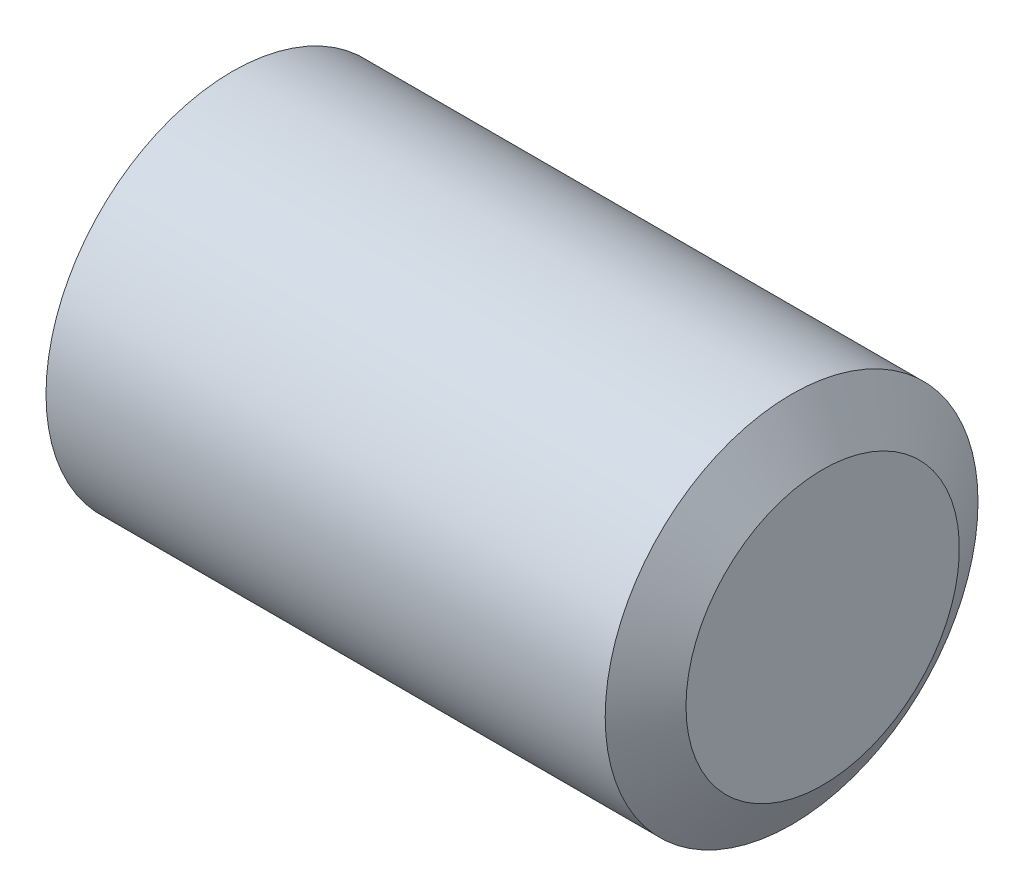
ISO-10303-21;
HEADER;
FILE_DESCRIPTION(('STEP AP214'),'2;1');
FILE_NAME('part.step','',(''),(''),'','','');
FILE_SCHEMA(('AUTOMOTIVE_DESIGN { 1 0 10303 214 1 1 1 1 }'));
ENDSEC;
DATA;
#1=APPLICATION_CONTEXT('core data for automotive mechanical design processes');
#2=APPLICATION_PROTOCOL_DEFINITION('international standard','automotive_design',2000,#1);
#3=PRODUCT_CONTEXT('',#1,'mechanical');
#4=PRODUCT('Part','Part','',(#3));
#5=PRODUCT_RELATED_PRODUCT_CATEGORY('part','',(#4));
#6=PRODUCT_DEFINITION_FORMATION('','',#4);
#7=PRODUCT_DEFINITION_CONTEXT('part definition',#1,'design');
#8=PRODUCT_DEFINITION('design','',#6,#7);
#9=PRODUCT_DEFINITION_SHAPE('','',#8);
#10=(LENGTH_UNIT() NAMED_UNIT(*) SI_UNIT(.MILLI.,.METRE.));
#11=(NAMED_UNIT(*) PLANE_ANGLE_UNIT() SI_UNIT($,.RADIAN.));
#12=(NAMED_UNIT(*) SI_UNIT($,.STERADIAN.) SOLID_ANGLE_UNIT());
#13=UNCERTAINTY_MEASURE_WITH_UNIT(LENGTH_MEASURE(1.E-05),#10,'distance_accuracy_value','');
#14=(GEOMETRIC_REPRESENTATION_CONTEXT(3) GLOBAL_UNCERTAINTY_ASSIGNED_CONTEXT((#13)) GLOBAL_UNIT_ASSIGNED_CONTEXT((#10,
#11,#12)) REPRESENTATION_CONTEXT('',''));
#15=CARTESIAN_POINT('',(0.,0.,0.));
#16=DIRECTION('',(0.,0.,1.));
#17=DIRECTION('',(1.,0.,0.));
#18=AXIS2_PLACEMENT_3D('',#15,#16,#17);
#19=CARTESIAN_POINT('',(0.,0.,0.));
#20=DIRECTION('',(1.,0.,0.));
#21=DIRECTION('',(0.,0.,-1.));
#22=AXIS2_PLACEMENT_3D('',#19,#20,#21);
#23=PLANE('',#22);
#24=CARTESIAN_POINT('',(0.,0.,0.));
#25=DIRECTION('',(-1.,0.,0.));
#26=DIRECTION('',(0.,0.,1.));
#27=AXIS2_PLACEMENT_3D('',#24,#25,#26);
#28=CIRCLE('',#27,22.);
#29=CARTESIAN_POINT('',(0.,0.,22.));
#30=VERTEX_POINT('',#29);
#31=EDGE_CURVE('E10',#30,#30,#28,.T.);
#32=ORIENTED_EDGE('',*,*,#31,.T.);
#33=EDGE_LOOP('',(#32));
#34=FACE_BOUND('',#33,.T.);
#35=ADVANCED_FACE('F33',(#34),#23,.F.);
#36=CARTESIAN_POINT('',(5.,0.,0.));
#37=DIRECTION('',(1.,0.,0.));
#38=DIRECTION('',(0.,0.,-1.));
#39=AXIS2_PLACEMENT_3D('',#36,#37,#38);
#40=CONICAL_SURFACE('',#39,30.,1.01219701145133);
#41=ORIENTED_EDGE('',*,*,#31,.F.);
#42=EDGE_LOOP('',(#41));
#43=FACE_BOUND('',#42,.T.);
#44=CARTESIAN_POINT('',(5.,0.,0.));
#45=DIRECTION('',(-1.,0.,0.));
#46=DIRECTION('',(0.,0.,1.));
#47=AXIS2_PLACEMENT_3D('',#44,#45,#46);
#48=CIRCLE('',#47,30.);
#49=CARTESIAN_POINT('',(5.,0.,30.));
#50=VERTEX_POINT('',#49);
#51=EDGE_CURVE('E39',#50,#50,#48,.T.);
#52=ORIENTED_EDGE('',*,*,#51,.T.);
#53=EDGE_LOOP('',(#52));
#54=FACE_BOUND('',#53,.T.);
#55=ADVANCED_FACE('F65',(#43,#54),#40,.T.);
#56=CARTESIAN_POINT('',(0.,0.,0.));
#57=DIRECTION('',(-1.,0.,0.));
#58=DIRECTION('',(0.,0.,1.));
#59=AXIS2_PLACEMENT_3D('',#56,#57,#58);
#60=CYLINDRICAL_SURFACE('',#59,30.);
#61=ORIENTED_EDGE('',*,*,#51,.F.);
#62=EDGE_LOOP('',(#61));
#63=FACE_BOUND('',#62,.T.);
#64=CARTESIAN_POINT('',(95.,0.,0.));
#65=DIRECTION('',(-1.,0.,0.));
#66=DIRECTION('',(0.,0.,1.));
#67=AXIS2_PLACEMENT_3D('',#64,#65,#66);
#68=CIRCLE('',#67,30.);
#69=CARTESIAN_POINT('',(95.,0.,30.));
#70=VERTEX_POINT('',#69);
#71=EDGE_CURVE('E43',#70,#70,#68,.T.);
#72=ORIENTED_EDGE('',*,*,#71,.T.);
#73=EDGE_LOOP('',(#72));
#74=FACE_BOUND('',#73,.T.);
#75=ADVANCED_FACE('F61',(#63,#74),#60,.T.);
#76=CARTESIAN_POINT('',(100.,0.,0.));
#77=DIRECTION('',(-1.,0.,0.));
#78=DIRECTION('',(0.,0.,1.));
#79=AXIS2_PLACEMENT_3D('',#76,#77,#78);
#80=CONICAL_SURFACE('',#79,22.,1.01219701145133);
#81=ORIENTED_EDGE('',*,*,#71,.F.);
#82=EDGE_LOOP('',(#81));
#83=FACE_BOUND('',#82,.T.);
#84=CARTESIAN_POINT('',(100.,0.,0.));
#85=DIRECTION('',(-1.,0.,0.));
#86=DIRECTION('',(0.,0.,1.));
#87=AXIS2_PLACEMENT_3D('',#84,#85,#86);
#88=CIRCLE('',#87,22.);
#89=CARTESIAN_POINT('',(100.,0.,22.));
#90=VERTEX_POINT('',#89);
#91=EDGE_CURVE('E47',#90,#90,#88,.T.);
#92=ORIENTED_EDGE('',*,*,#91,.T.);
#93=EDGE_LOOP('',(#92));
#94=FACE_BOUND('',#93,.T.);
#95=ADVANCED_FACE('F53',(#83,#94),#80,.T.);
#96=CARTESIAN_POINT('',(100.,0.,0.));
#97=DIRECTION('',(-1.,0.,0.));
#98=DIRECTION('',(0.,0.,1.));
#99=AXIS2_PLACEMENT_3D('',#96,#97,#98);
#100=PLANE('',#99);
#101=ORIENTED_EDGE('',*,*,#91,.F.);
#102=EDGE_LOOP('',(#101));
#103=FACE_BOUND('',#102,.T.);
#104=ADVANCED_FACE('F55',(#103),#100,.F.);
#105=CLOSED_SHELL('',(#35,#55,#75,#95,#104));
#106=MANIFOLD_SOLID_BREP('B2',#105);
#107=ADVANCED_BREP_SHAPE_REPRESENTATION('',(#18,#106),#14);
#108=SHAPE_DEFINITION_REPRESENTATION(#9,#107);
ENDSEC;
END-ISO-10303-21;
